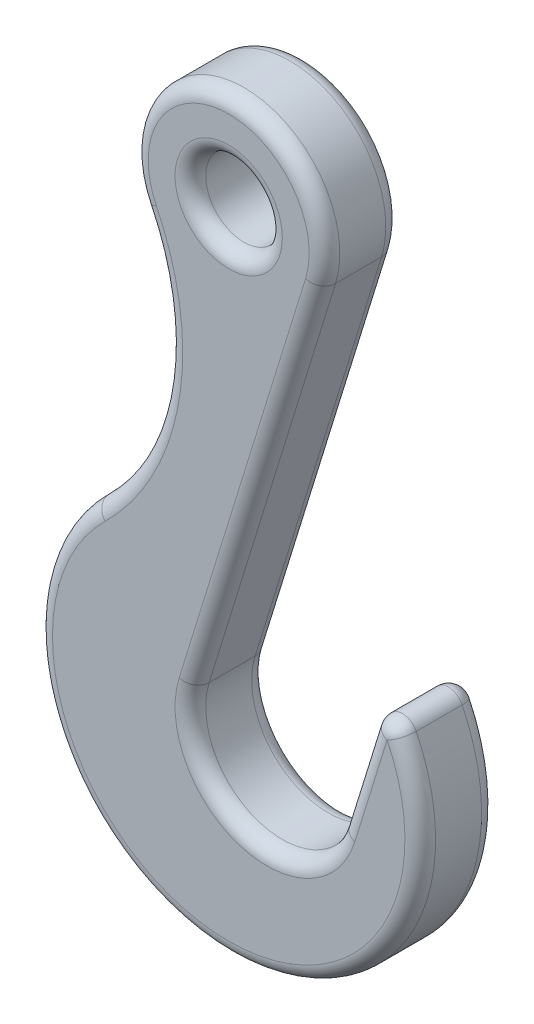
ISO-10303-21;
HEADER;
FILE_DESCRIPTION(('STEP AP214'),'2;1');
FILE_NAME('part.step','',(''),(''),'','','');
FILE_SCHEMA(('AUTOMOTIVE_DESIGN { 1 0 10303 214 1 1 1 1 }'));
ENDSEC;
DATA;
#1=APPLICATION_CONTEXT('core data for automotive mechanical design processes');
#2=APPLICATION_PROTOCOL_DEFINITION('international standard','automotive_design',2000,#1);
#3=PRODUCT_CONTEXT('',#1,'mechanical');
#4=PRODUCT('Part','Part','',(#3));
#5=PRODUCT_RELATED_PRODUCT_CATEGORY('part','',(#4));
#6=PRODUCT_DEFINITION_FORMATION('','',#4);
#7=PRODUCT_DEFINITION_CONTEXT('part definition',#1,'design');
#8=PRODUCT_DEFINITION('design','',#6,#7);
#9=PRODUCT_DEFINITION_SHAPE('','',#8);
#10=(LENGTH_UNIT() NAMED_UNIT(*) SI_UNIT(.MILLI.,.METRE.));
#11=(NAMED_UNIT(*) PLANE_ANGLE_UNIT() SI_UNIT($,.RADIAN.));
#12=(NAMED_UNIT(*) SI_UNIT($,.STERADIAN.) SOLID_ANGLE_UNIT());
#13=UNCERTAINTY_MEASURE_WITH_UNIT(LENGTH_MEASURE(1.E-05),#10,'distance_accuracy_value','');
#14=(GEOMETRIC_REPRESENTATION_CONTEXT(3) GLOBAL_UNCERTAINTY_ASSIGNED_CONTEXT((#13)) GLOBAL_UNIT_ASSIGNED_CONTEXT((#10,
#11,#12)) REPRESENTATION_CONTEXT('',''));
#15=CARTESIAN_POINT('',(0.,0.,0.));
#16=DIRECTION('',(0.,0.,1.));
#17=DIRECTION('',(1.,0.,0.));
#18=AXIS2_PLACEMENT_3D('',#15,#16,#17);
#19=CARTESIAN_POINT('',(0.,60.,10.));
#20=DIRECTION('',(0.,0.,1.));
#21=DIRECTION('',(1.,0.,0.));
#22=AXIS2_PLACEMENT_3D('',#19,#20,#21);
#23=PLANE('',#22);
#24=CARTESIAN_POINT('',(0.,60.,10.));
#25=DIRECTION('',(0.,0.,1.));
#26=DIRECTION('',(1.,0.,0.));
#27=AXIS2_PLACEMENT_3D('',#24,#25,#26);
#28=CIRCLE('',#27,7.);
#29=CARTESIAN_POINT('',(7.,60.,10.));
#30=VERTEX_POINT('',#29);
#31=EDGE_CURVE('E11',#30,#30,#28,.F.);
#32=ORIENTED_EDGE('',*,*,#31,.T.);
#33=EDGE_LOOP('',(#32));
#34=FACE_BOUND('',#33,.T.);
#35=CARTESIAN_POINT('',(0.,60.,10.));
#36=DIRECTION('',(0.,0.,1.));
#37=DIRECTION('',(1.,0.,0.));
#38=AXIS2_PLACEMENT_3D('',#35,#36,#37);
#39=CIRCLE('',#38,10.5);
#40=CARTESIAN_POINT('',(10.0314717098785,56.8984559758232,10.));
#41=VERTEX_POINT('',#40);
#42=CARTESIAN_POINT('',(-9.43422721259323,55.3907314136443,10.));
#43=VERTEX_POINT('',#42);
#44=EDGE_CURVE('E51',#41,#43,#39,.T.);
#45=ORIENTED_EDGE('',*,*,#44,.T.);
#46=CARTESIAN_POINT('',(-39.8340274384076,40.5383390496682,10.));
#47=DIRECTION('',(0.,0.,1.));
#48=DIRECTION('',(1.,0.,0.));
#49=AXIS2_PLACEMENT_3D('',#46,#47,#48);
#50=CIRCLE('',#49,33.8340274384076);
#51=CARTESIAN_POINT('',(-16.1203186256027,16.4053444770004,10.));
#52=VERTEX_POINT('',#51);
#53=EDGE_CURVE('E43',#43,#52,#50,.F.);
#54=ORIENTED_EDGE('',*,*,#53,.T.);
#55=CARTESIAN_POINT('',(0.,0.,10.));
#56=DIRECTION('',(0.,0.,1.));
#57=DIRECTION('',(1.,0.,0.));
#58=AXIS2_PLACEMENT_3D('',#55,#56,#57);
#59=CIRCLE('',#58,23.);
#60=CARTESIAN_POINT('',(20.6756526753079,10.0755836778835,10.));
#61=VERTEX_POINT('',#60);
#62=EDGE_CURVE('E200',#52,#61,#59,.T.);
#63=ORIENTED_EDGE('',*,*,#62,.T.);
#64=DIRECTION('',(-0.295385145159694,-0.955378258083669,0.));
#65=VECTOR('',#64,1.);
#66=CARTESIAN_POINT('',(16.464539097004,-3.54462174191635,10.));
#67=LINE('',#66,#65);
#68=CARTESIAN_POINT('',(16.464539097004,-3.54462174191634,10.));
#69=VERTEX_POINT('',#68);
#70=EDGE_CURVE('E202',#61,#69,#67,.T.);
#71=ORIENTED_EDGE('',*,*,#70,.T.);
#72=CARTESIAN_POINT('',(5.,0.,10.));
#73=DIRECTION('',(0.,0.,1.));
#74=DIRECTION('',(1.,0.,0.));
#75=AXIS2_PLACEMENT_3D('',#72,#73,#74);
#76=CIRCLE('',#75,12.);
#77=CARTESIAN_POINT('',(-6.46453909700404,3.54462174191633,10.));
#78=VERTEX_POINT('',#77);
#79=EDGE_CURVE('E204',#69,#78,#76,.F.);
#80=ORIENTED_EDGE('',*,*,#79,.T.);
#81=DIRECTION('',(0.295385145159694,0.955378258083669,0.));
#82=VECTOR('',#81,1.);
#83=CARTESIAN_POINT('',(10.0314717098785,56.8984559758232,10.));
#84=LINE('',#83,#82);
#85=EDGE_CURVE('E56',#78,#41,#84,.T.);
#86=ORIENTED_EDGE('',*,*,#85,.T.);
#87=EDGE_LOOP('',(#45,#54,#63,#71,#80,#86));
#88=FACE_BOUND('',#87,.T.);
#89=ADVANCED_FACE('F34',(#34,#88),#23,.T.);
#90=CARTESIAN_POINT('',(0.,60.,0.));
#91=DIRECTION('',(0.,0.,1.));
#92=DIRECTION('',(1.,0.,0.));
#93=AXIS2_PLACEMENT_3D('',#90,#91,#92);
#94=PLANE('',#93);
#95=CARTESIAN_POINT('',(0.,60.,0.));
#96=DIRECTION('',(0.,0.,1.));
#97=DIRECTION('',(1.,0.,0.));
#98=AXIS2_PLACEMENT_3D('',#95,#96,#97);
#99=CIRCLE('',#98,7.);
#100=CARTESIAN_POINT('',(7.,60.,0.));
#101=VERTEX_POINT('',#100);
#102=EDGE_CURVE('E158',#101,#101,#99,.T.);
#103=ORIENTED_EDGE('',*,*,#102,.T.);
#104=EDGE_LOOP('',(#103));
#105=FACE_BOUND('',#104,.T.);
#106=DIRECTION('',(0.295385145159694,0.955378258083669,0.));
#107=VECTOR('',#106,1.);
#108=CARTESIAN_POINT('',(10.0314717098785,56.8984559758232,0.));
#109=LINE('',#108,#107);
#110=CARTESIAN_POINT('',(10.0314717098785,56.8984559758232,0.));
#111=VERTEX_POINT('',#110);
#112=CARTESIAN_POINT('',(-6.46453909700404,3.54462174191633,0.));
#113=VERTEX_POINT('',#112);
#114=EDGE_CURVE('E157',#111,#113,#109,.F.);
#115=ORIENTED_EDGE('',*,*,#114,.T.);
#116=CARTESIAN_POINT('',(5.,0.,0.));
#117=DIRECTION('',(0.,0.,1.));
#118=DIRECTION('',(1.,0.,0.));
#119=AXIS2_PLACEMENT_3D('',#116,#117,#118);
#120=CIRCLE('',#119,12.);
#121=CARTESIAN_POINT('',(16.464539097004,-3.54462174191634,0.));
#122=VERTEX_POINT('',#121);
#123=EDGE_CURVE('E136',#113,#122,#120,.T.);
#124=ORIENTED_EDGE('',*,*,#123,.T.);
#125=DIRECTION('',(-0.295385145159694,-0.955378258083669,0.));
#126=VECTOR('',#125,1.);
#127=CARTESIAN_POINT('',(32.9605499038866,49.8092124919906,0.));
#128=LINE('',#127,#126);
#129=CARTESIAN_POINT('',(20.6756526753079,10.0755836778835,0.));
#130=VERTEX_POINT('',#129);
#131=EDGE_CURVE('E146',#122,#130,#128,.F.);
#132=ORIENTED_EDGE('',*,*,#131,.T.);
#133=CARTESIAN_POINT('',(0.,0.,0.));
#134=DIRECTION('',(0.,0.,1.));
#135=DIRECTION('',(1.,0.,0.));
#136=AXIS2_PLACEMENT_3D('',#133,#134,#135);
#137=CIRCLE('',#136,23.);
#138=CARTESIAN_POINT('',(-16.1203186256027,16.4053444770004,0.));
#139=VERTEX_POINT('',#138);
#140=EDGE_CURVE('E152',#130,#139,#137,.F.);
#141=ORIENTED_EDGE('',*,*,#140,.T.);
#142=CARTESIAN_POINT('',(-39.8340274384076,40.5383390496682,0.));
#143=DIRECTION('',(0.,0.,1.));
#144=DIRECTION('',(1.,0.,0.));
#145=AXIS2_PLACEMENT_3D('',#142,#143,#144);
#146=CIRCLE('',#145,33.8340274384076);
#147=CARTESIAN_POINT('',(-9.43422721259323,55.3907314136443,0.));
#148=VERTEX_POINT('',#147);
#149=EDGE_CURVE('E279',#139,#148,#146,.T.);
#150=ORIENTED_EDGE('',*,*,#149,.T.);
#151=CARTESIAN_POINT('',(0.,60.,0.));
#152=DIRECTION('',(0.,0.,1.));
#153=DIRECTION('',(1.,0.,0.));
#154=AXIS2_PLACEMENT_3D('',#151,#152,#153);
#155=CIRCLE('',#154,10.5);
#156=EDGE_CURVE('E163',#148,#111,#155,.F.);
#157=ORIENTED_EDGE('',*,*,#156,.T.);
#158=EDGE_LOOP('',(#115,#124,#132,#141,#150,#157));
#159=FACE_BOUND('',#158,.T.);
#160=ADVANCED_FACE('F155',(#105,#159),#94,.F.);
#161=CARTESIAN_POINT('',(0.,60.,10.));
#162=DIRECTION('',(0.,0.,-1.));
#163=DIRECTION('',(-1.,0.,0.));
#164=AXIS2_PLACEMENT_3D('',#161,#162,#163);
#165=CYLINDRICAL_SURFACE('',#164,12.5);
#166=DIRECTION('',(0.,0.,-1.));
#167=VECTOR('',#166,1.);
#168=CARTESIAN_POINT('',(11.9422282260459,56.3076856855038,10.));
#169=LINE('',#168,#167);
#170=CARTESIAN_POINT('',(11.9422282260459,56.3076856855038,8.));
#171=VERTEX_POINT('',#170);
#172=CARTESIAN_POINT('',(11.9422282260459,56.3076856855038,2.));
#173=VERTEX_POINT('',#172);
#174=EDGE_CURVE('E222',#171,#173,#169,.T.);
#175=ORIENTED_EDGE('',*,*,#174,.T.);
#176=CARTESIAN_POINT('',(0.,60.,2.));
#177=DIRECTION('',(0.,0.,1.));
#178=DIRECTION('',(1.,0.,0.));
#179=AXIS2_PLACEMENT_3D('',#176,#177,#178);
#180=CIRCLE('',#179,12.5);
#181=CARTESIAN_POINT('',(-11.2312228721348,54.5127754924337,2.));
#182=VERTEX_POINT('',#181);
#183=EDGE_CURVE('E181',#173,#182,#180,.T.);
#184=ORIENTED_EDGE('',*,*,#183,.T.);
#185=DIRECTION('',(0.,0.,-1.));
#186=VECTOR('',#185,1.);
#187=CARTESIAN_POINT('',(-11.2312228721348,54.5127754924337,10.));
#188=LINE('',#187,#186);
#189=CARTESIAN_POINT('',(-11.2312228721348,54.5127754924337,8.));
#190=VERTEX_POINT('',#189);
#191=EDGE_CURVE('E274',#190,#182,#188,.T.);
#192=ORIENTED_EDGE('',*,*,#191,.F.);
#193=CARTESIAN_POINT('',(0.,60.,8.));
#194=DIRECTION('',(0.,0.,1.));
#195=DIRECTION('',(1.,0.,0.));
#196=AXIS2_PLACEMENT_3D('',#193,#194,#195);
#197=CIRCLE('',#196,12.5);
#198=EDGE_CURVE('E179',#190,#171,#197,.F.);
#199=ORIENTED_EDGE('',*,*,#198,.T.);
#200=EDGE_LOOP('',(#175,#184,#192,#199));
#201=FACE_BOUND('',#200,.T.);
#202=ADVANCED_FACE('F338',(#201),#165,.T.);
#203=CARTESIAN_POINT('',(-39.8340274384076,40.5383390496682,10.));
#204=DIRECTION('',(0.,0.,-1.));
#205=DIRECTION('',(-1.,0.,0.));
#206=AXIS2_PLACEMENT_3D('',#203,#204,#205);
#207=CYLINDRICAL_SURFACE('',#206,31.8340274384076);
#208=ORIENTED_EDGE('',*,*,#191,.T.);
#209=CARTESIAN_POINT('',(-39.8340274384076,40.5383390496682,2.));
#210=DIRECTION('',(0.,0.,1.));
#211=DIRECTION('',(1.,0.,0.));
#212=AXIS2_PLACEMENT_3D('',#209,#210,#211);
#213=CIRCLE('',#212,31.8340274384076);
#214=CARTESIAN_POINT('',(-17.5220854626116,17.8318961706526,2.));
#215=VERTEX_POINT('',#214);
#216=EDGE_CURVE('E186',#182,#215,#213,.F.);
#217=ORIENTED_EDGE('',*,*,#216,.T.);
#218=DIRECTION('',(0.,0.,-1.));
#219=VECTOR('',#218,1.);
#220=CARTESIAN_POINT('',(-17.5220854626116,17.8318961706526,10.));
#221=LINE('',#220,#219);
#222=CARTESIAN_POINT('',(-17.5220854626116,17.8318961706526,8.));
#223=VERTEX_POINT('',#222);
#224=EDGE_CURVE('E303',#223,#215,#221,.T.);
#225=ORIENTED_EDGE('',*,*,#224,.F.);
#226=CARTESIAN_POINT('',(-39.8340274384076,40.5383390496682,8.));
#227=DIRECTION('',(0.,0.,1.));
#228=DIRECTION('',(1.,0.,0.));
#229=AXIS2_PLACEMENT_3D('',#226,#227,#228);
#230=CIRCLE('',#229,31.8340274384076);
#231=EDGE_CURVE('E183',#223,#190,#230,.T.);
#232=ORIENTED_EDGE('',*,*,#231,.T.);
#233=EDGE_LOOP('',(#208,#217,#225,#232));
#234=FACE_BOUND('',#233,.T.);
#235=ADVANCED_FACE('F311',(#234),#207,.F.);
#236=CARTESIAN_POINT('',(0.,0.,10.));
#237=DIRECTION('',(0.,0.,-1.));
#238=DIRECTION('',(-1.,0.,0.));
#239=AXIS2_PLACEMENT_3D('',#236,#237,#238);
#240=CYLINDRICAL_SURFACE('',#239,25.);
#241=ORIENTED_EDGE('',*,*,#224,.T.);
#242=CARTESIAN_POINT('',(0.,0.,2.));
#243=DIRECTION('',(0.,0.,1.));
#244=DIRECTION('',(1.,0.,0.));
#245=AXIS2_PLACEMENT_3D('',#242,#243,#244);
#246=CIRCLE('',#245,25.);
#247=CARTESIAN_POINT('',(22.473535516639,10.9517213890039,2.));
#248=VERTEX_POINT('',#247);
#249=EDGE_CURVE('E190',#215,#248,#246,.T.);
#250=ORIENTED_EDGE('',*,*,#249,.T.);
#251=DIRECTION('',(0.,0.,-1.));
#252=VECTOR('',#251,1.);
#253=CARTESIAN_POINT('',(22.473535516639,10.9517213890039,10.));
#254=LINE('',#253,#252);
#255=CARTESIAN_POINT('',(22.473535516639,10.9517213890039,8.));
#256=VERTEX_POINT('',#255);
#257=EDGE_CURVE('E153',#248,#256,#254,.F.);
#258=ORIENTED_EDGE('',*,*,#257,.T.);
#259=CARTESIAN_POINT('',(0.,0.,8.));
#260=DIRECTION('',(0.,0.,1.));
#261=DIRECTION('',(1.,0.,0.));
#262=AXIS2_PLACEMENT_3D('',#259,#260,#261);
#263=CIRCLE('',#262,25.);
#264=EDGE_CURVE('E188',#256,#223,#263,.F.);
#265=ORIENTED_EDGE('',*,*,#264,.T.);
#266=EDGE_LOOP('',(#241,#250,#258,#265));
#267=FACE_BOUND('',#266,.T.);
#268=ADVANCED_FACE('F270',(#267),#240,.T.);
#269=CARTESIAN_POINT('',(14.5537825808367,-2.95385145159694,10.));
#270=DIRECTION('',(0.955378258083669,-0.295385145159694,0.));
#271=DIRECTION('',(0.295385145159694,0.955378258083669,0.));
#272=AXIS2_PLACEMENT_3D('',#269,#270,#271);
#273=PLANE('',#272);
#274=DIRECTION('',(0.,0.,-1.));
#275=VECTOR('',#274,1.);
#276=CARTESIAN_POINT('',(18.7648961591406,10.6663539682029,10.));
#277=LINE('',#276,#275);
#278=CARTESIAN_POINT('',(18.7648961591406,10.6663539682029,8.));
#279=VERTEX_POINT('',#278);
#280=CARTESIAN_POINT('',(18.7648961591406,10.6663539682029,2.));
#281=VERTEX_POINT('',#280);
#282=EDGE_CURVE('E267',#279,#281,#277,.T.);
#283=ORIENTED_EDGE('',*,*,#282,.T.);
#284=DIRECTION('',(-0.295385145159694,-0.955378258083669,0.));
#285=VECTOR('',#284,1.);
#286=CARTESIAN_POINT('',(14.5537825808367,-2.95385145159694,2.));
#287=LINE('',#286,#285);
#288=CARTESIAN_POINT('',(14.5537825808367,-2.95385145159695,2.));
#289=VERTEX_POINT('',#288);
#290=EDGE_CURVE('E198',#281,#289,#287,.T.);
#291=ORIENTED_EDGE('',*,*,#290,.T.);
#292=DIRECTION('',(0.,0.,-1.));
#293=VECTOR('',#292,1.);
#294=CARTESIAN_POINT('',(14.5537825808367,-2.95385145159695,10.));
#295=LINE('',#294,#293);
#296=CARTESIAN_POINT('',(14.5537825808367,-2.95385145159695,8.));
#297=VERTEX_POINT('',#296);
#298=EDGE_CURVE('E300',#297,#289,#295,.T.);
#299=ORIENTED_EDGE('',*,*,#298,.F.);
#300=DIRECTION('',(-0.295385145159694,-0.955378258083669,0.));
#301=VECTOR('',#300,1.);
#302=CARTESIAN_POINT('',(18.7648961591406,10.6663539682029,8.));
#303=LINE('',#302,#301);
#304=EDGE_CURVE('E196',#297,#279,#303,.F.);
#305=ORIENTED_EDGE('',*,*,#304,.T.);
#306=EDGE_LOOP('',(#283,#291,#299,#305));
#307=FACE_BOUND('',#306,.T.);
#308=ADVANCED_FACE('F323',(#307),#273,.F.);
#309=CARTESIAN_POINT('',(5.,0.,10.));
#310=DIRECTION('',(0.,0.,-1.));
#311=DIRECTION('',(-1.,0.,0.));
#312=AXIS2_PLACEMENT_3D('',#309,#310,#311);
#313=CYLINDRICAL_SURFACE('',#312,10.);
#314=ORIENTED_EDGE('',*,*,#298,.T.);
#315=CARTESIAN_POINT('',(5.,0.,2.));
#316=DIRECTION('',(0.,0.,1.));
#317=DIRECTION('',(1.,0.,0.));
#318=AXIS2_PLACEMENT_3D('',#315,#316,#317);
#319=CIRCLE('',#318,10.);
#320=CARTESIAN_POINT('',(-4.5537825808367,2.95385145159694,2.));
#321=VERTEX_POINT('',#320);
#322=EDGE_CURVE('E139',#289,#321,#319,.F.);
#323=ORIENTED_EDGE('',*,*,#322,.T.);
#324=DIRECTION('',(0.,0.,-1.));
#325=VECTOR('',#324,1.);
#326=CARTESIAN_POINT('',(-4.5537825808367,2.95385145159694,10.));
#327=LINE('',#326,#325);
#328=CARTESIAN_POINT('',(-4.5537825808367,2.95385145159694,8.));
#329=VERTEX_POINT('',#328);
#330=EDGE_CURVE('E298',#329,#321,#327,.T.);
#331=ORIENTED_EDGE('',*,*,#330,.F.);
#332=CARTESIAN_POINT('',(5.,0.,8.));
#333=DIRECTION('',(0.,0.,1.));
#334=DIRECTION('',(1.,0.,0.));
#335=AXIS2_PLACEMENT_3D('',#332,#333,#334);
#336=CIRCLE('',#335,10.);
#337=EDGE_CURVE('E172',#329,#297,#336,.T.);
#338=ORIENTED_EDGE('',*,*,#337,.T.);
#339=EDGE_LOOP('',(#314,#323,#331,#338));
#340=FACE_BOUND('',#339,.T.);
#341=ADVANCED_FACE('F297',(#340),#313,.F.);
#342=CARTESIAN_POINT('',(11.9422282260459,56.3076856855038,10.));
#343=DIRECTION('',(-0.955378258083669,0.295385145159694,0.));
#344=DIRECTION('',(-0.295385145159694,-0.955378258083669,0.));
#345=AXIS2_PLACEMENT_3D('',#342,#343,#344);
#346=PLANE('',#345);
#347=ORIENTED_EDGE('',*,*,#330,.T.);
#348=DIRECTION('',(0.295385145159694,0.955378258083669,0.));
#349=VECTOR('',#348,1.);
#350=CARTESIAN_POINT('',(11.9422282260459,56.3076856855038,2.));
#351=LINE('',#350,#349);
#352=EDGE_CURVE('E177',#321,#173,#351,.T.);
#353=ORIENTED_EDGE('',*,*,#352,.T.);
#354=ORIENTED_EDGE('',*,*,#174,.F.);
#355=DIRECTION('',(0.295385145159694,0.955378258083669,0.));
#356=VECTOR('',#355,1.);
#357=CARTESIAN_POINT('',(-4.55378258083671,2.95385145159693,8.));
#358=LINE('',#357,#356);
#359=EDGE_CURVE('E175',#171,#329,#358,.F.);
#360=ORIENTED_EDGE('',*,*,#359,.T.);
#361=EDGE_LOOP('',(#347,#353,#354,#360));
#362=FACE_BOUND('',#361,.T.);
#363=ADVANCED_FACE('F301',(#362),#346,.F.);
#364=CARTESIAN_POINT('',(0.,60.,10.));
#365=DIRECTION('',(0.,0.,-1.));
#366=DIRECTION('',(-1.,0.,0.));
#367=AXIS2_PLACEMENT_3D('',#364,#365,#366);
#368=CYLINDRICAL_SURFACE('',#367,5.);
#369=CARTESIAN_POINT('',(0.,60.,2.));
#370=DIRECTION('',(0.,0.,1.));
#371=DIRECTION('',(1.,0.,0.));
#372=AXIS2_PLACEMENT_3D('',#369,#370,#371);
#373=CIRCLE('',#372,5.);
#374=CARTESIAN_POINT('',(5.,60.,2.));
#375=VERTEX_POINT('',#374);
#376=EDGE_CURVE('E169',#375,#375,#373,.F.);
#377=ORIENTED_EDGE('',*,*,#376,.T.);
#378=EDGE_LOOP('',(#377));
#379=FACE_BOUND('',#378,.T.);
#380=CARTESIAN_POINT('',(0.,60.,8.));
#381=DIRECTION('',(0.,0.,1.));
#382=DIRECTION('',(1.,0.,0.));
#383=AXIS2_PLACEMENT_3D('',#380,#381,#382);
#384=CIRCLE('',#383,5.);
#385=CARTESIAN_POINT('',(5.,60.,8.));
#386=VERTEX_POINT('',#385);
#387=EDGE_CURVE('E161',#386,#386,#384,.T.);
#388=ORIENTED_EDGE('',*,*,#387,.T.);
#389=EDGE_LOOP('',(#388));
#390=FACE_BOUND('',#389,.T.);
#391=ADVANCED_FACE('F342',(#379,#390),#368,.F.);
#392=CARTESIAN_POINT('',(20.6756526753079,10.0755836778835,10.));
#393=DIRECTION('',(0.,0.,-1.));
#394=DIRECTION('',(-1.,0.,0.));
#395=AXIS2_PLACEMENT_3D('',#392,#393,#394);
#396=CYLINDRICAL_SURFACE('',#395,2.);
#397=ORIENTED_EDGE('',*,*,#257,.F.);
#398=CARTESIAN_POINT('',(20.6756526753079,10.0755836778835,2.));
#399=DIRECTION('',(0.,0.,-1.));
#400=DIRECTION('',(-1.,0.,0.));
#401=AXIS2_PLACEMENT_3D('',#398,#399,#400);
#402=CIRCLE('',#401,2.);
#403=EDGE_CURVE('E194',#248,#281,#402,.F.);
#404=ORIENTED_EDGE('',*,*,#403,.T.);
#405=ORIENTED_EDGE('',*,*,#282,.F.);
#406=CARTESIAN_POINT('',(20.6756526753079,10.0755836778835,8.));
#407=DIRECTION('',(0.,0.,-1.));
#408=DIRECTION('',(-1.,0.,0.));
#409=AXIS2_PLACEMENT_3D('',#406,#407,#408);
#410=CIRCLE('',#409,2.);
#411=EDGE_CURVE('E192',#279,#256,#410,.T.);
#412=ORIENTED_EDGE('',*,*,#411,.T.);
#413=EDGE_LOOP('',(#397,#404,#405,#412));
#414=FACE_BOUND('',#413,.T.);
#415=ADVANCED_FACE('F264',(#414),#396,.T.);
#416=CARTESIAN_POINT('',(0.,60.,2.));
#417=DIRECTION('',(0.,0.,1.));
#418=DIRECTION('',(1.,0.,0.));
#419=AXIS2_PLACEMENT_3D('',#416,#417,#418);
#420=TOROIDAL_SURFACE('',#419,7.,2.);
#421=ORIENTED_EDGE('',*,*,#376,.F.);
#422=EDGE_LOOP('',(#421));
#423=FACE_BOUND('',#422,.T.);
#424=ORIENTED_EDGE('',*,*,#102,.F.);
#425=EDGE_LOOP('',(#424));
#426=FACE_BOUND('',#425,.T.);
#427=ADVANCED_FACE('F352',(#423,#426),#420,.T.);
#428=CARTESIAN_POINT('',(0.,0.,2.));
#429=DIRECTION('',(0.,0.,1.));
#430=DIRECTION('',(1.,0.,0.));
#431=AXIS2_PLACEMENT_3D('',#428,#429,#430);
#432=TOROIDAL_SURFACE('',#431,23.,2.);
#433=CARTESIAN_POINT('',(20.6756526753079,10.0755836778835,2.));
#434=DIRECTION('',(-0.438068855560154,0.898941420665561,0.));
#435=DIRECTION('',(-0.898941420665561,-0.438068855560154,0.));
#436=AXIS2_PLACEMENT_3D('',#433,#434,#435);
#437=CIRCLE('',#436,2.);
#438=EDGE_CURVE('E216',#248,#130,#437,.T.);
#439=ORIENTED_EDGE('',*,*,#438,.F.);
#440=ORIENTED_EDGE('',*,*,#249,.F.);
#441=CARTESIAN_POINT('',(-16.1203186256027,16.4053444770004,2.));
#442=DIRECTION('',(0.713275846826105,0.700883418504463,0.));
#443=DIRECTION('',(-0.700883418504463,0.713275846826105,0.));
#444=AXIS2_PLACEMENT_3D('',#441,#442,#443);
#445=CIRCLE('',#444,2.);
#446=EDGE_CURVE('E219',#139,#215,#445,.T.);
#447=ORIENTED_EDGE('',*,*,#446,.F.);
#448=ORIENTED_EDGE('',*,*,#140,.F.);
#449=EDGE_LOOP('',(#439,#440,#447,#448));
#450=FACE_BOUND('',#449,.T.);
#451=ADVANCED_FACE('F318',(#450),#432,.T.);
#452=CARTESIAN_POINT('',(-39.8340274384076,40.5383390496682,2.));
#453=DIRECTION('',(0.,0.,1.));
#454=DIRECTION('',(1.,0.,0.));
#455=AXIS2_PLACEMENT_3D('',#452,#453,#454);
#456=TOROIDAL_SURFACE('',#455,33.8340274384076,2.);
#457=ORIENTED_EDGE('',*,*,#446,.T.);
#458=ORIENTED_EDGE('',*,*,#216,.F.);
#459=CARTESIAN_POINT('',(-9.43422721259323,55.3907314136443,2.));
#460=DIRECTION('',(-0.438977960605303,0.898497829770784,0.));
#461=DIRECTION('',(-0.898497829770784,-0.438977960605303,0.));
#462=AXIS2_PLACEMENT_3D('',#459,#460,#461);
#463=CIRCLE('',#462,2.);
#464=EDGE_CURVE('E213',#148,#182,#463,.T.);
#465=ORIENTED_EDGE('',*,*,#464,.F.);
#466=ORIENTED_EDGE('',*,*,#149,.F.);
#467=EDGE_LOOP('',(#457,#458,#465,#466));
#468=FACE_BOUND('',#467,.T.);
#469=ADVANCED_FACE('F315',(#468),#456,.T.);
#470=CARTESIAN_POINT('',(20.6756526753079,10.0755836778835,2.));
#471=DIRECTION('',(0.,0.,1.));
#472=DIRECTION('',(1.,0.,0.));
#473=AXIS2_PLACEMENT_3D('',#470,#471,#472);
#474=SPHERICAL_SURFACE('',#473,2.);
#475=ORIENTED_EDGE('',*,*,#403,.F.);
#476=ORIENTED_EDGE('',*,*,#438,.T.);
#477=CARTESIAN_POINT('',(20.6756526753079,10.0755836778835,2.));
#478=DIRECTION('',(-0.295385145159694,-0.955378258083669,0.));
#479=DIRECTION('',(0.95537825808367,-0.295385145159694,0.));
#480=AXIS2_PLACEMENT_3D('',#477,#478,#479);
#481=CIRCLE('',#480,2.);
#482=EDGE_CURVE('E149',#281,#130,#481,.T.);
#483=ORIENTED_EDGE('',*,*,#482,.F.);
#484=EDGE_LOOP('',(#475,#476,#483));
#485=FACE_BOUND('',#484,.T.);
#486=ADVANCED_FACE('F321',(#485),#474,.T.);
#487=CARTESIAN_POINT('',(0.,60.,2.));
#488=DIRECTION('',(0.,0.,1.));
#489=DIRECTION('',(1.,0.,0.));
#490=AXIS2_PLACEMENT_3D('',#487,#488,#489);
#491=TOROIDAL_SURFACE('',#490,10.5,2.);
#492=ORIENTED_EDGE('',*,*,#464,.T.);
#493=ORIENTED_EDGE('',*,*,#183,.F.);
#494=CARTESIAN_POINT('',(10.0314717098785,56.8984559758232,2.));
#495=DIRECTION('',(-0.295385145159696,-0.955378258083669,0.));
#496=DIRECTION('',(0.955378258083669,-0.295385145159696,0.));
#497=AXIS2_PLACEMENT_3D('',#494,#495,#496);
#498=CIRCLE('',#497,2.);
#499=EDGE_CURVE('E142',#111,#173,#498,.T.);
#500=ORIENTED_EDGE('',*,*,#499,.F.);
#501=ORIENTED_EDGE('',*,*,#156,.F.);
#502=EDGE_LOOP('',(#492,#493,#500,#501));
#503=FACE_BOUND('',#502,.T.);
#504=ADVANCED_FACE('F286',(#503),#491,.T.);
#505=CARTESIAN_POINT('',(16.464539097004,-3.54462174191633,2.));
#506=DIRECTION('',(-0.295385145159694,-0.955378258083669,0.));
#507=DIRECTION('',(0.955378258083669,-0.295385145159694,0.));
#508=AXIS2_PLACEMENT_3D('',#505,#506,#507);
#509=CYLINDRICAL_SURFACE('',#508,2.);
#510=ORIENTED_EDGE('',*,*,#482,.T.);
#511=ORIENTED_EDGE('',*,*,#131,.F.);
#512=CARTESIAN_POINT('',(16.464539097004,-3.54462174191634,2.));
#513=DIRECTION('',(-0.295385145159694,-0.955378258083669,0.));
#514=DIRECTION('',(0.955378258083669,-0.295385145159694,0.));
#515=AXIS2_PLACEMENT_3D('',#512,#513,#514);
#516=CIRCLE('',#515,2.);
#517=EDGE_CURVE('E132',#289,#122,#516,.T.);
#518=ORIENTED_EDGE('',*,*,#517,.F.);
#519=ORIENTED_EDGE('',*,*,#290,.F.);
#520=EDGE_LOOP('',(#510,#511,#518,#519));
#521=FACE_BOUND('',#520,.T.);
#522=ADVANCED_FACE('F147',(#521),#509,.T.);
#523=CARTESIAN_POINT('',(10.0314717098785,56.8984559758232,2.));
#524=DIRECTION('',(0.295385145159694,0.955378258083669,0.));
#525=DIRECTION('',(-0.955378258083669,0.295385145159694,0.));
#526=AXIS2_PLACEMENT_3D('',#523,#524,#525);
#527=CYLINDRICAL_SURFACE('',#526,2.);
#528=ORIENTED_EDGE('',*,*,#499,.T.);
#529=ORIENTED_EDGE('',*,*,#352,.F.);
#530=CARTESIAN_POINT('',(-6.46453909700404,3.54462174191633,2.));
#531=DIRECTION('',(-0.295385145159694,-0.955378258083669,0.));
#532=DIRECTION('',(0.955378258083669,-0.295385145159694,0.));
#533=AXIS2_PLACEMENT_3D('',#530,#531,#532);
#534=CIRCLE('',#533,2.);
#535=EDGE_CURVE('E143',#113,#321,#534,.T.);
#536=ORIENTED_EDGE('',*,*,#535,.F.);
#537=ORIENTED_EDGE('',*,*,#114,.F.);
#538=EDGE_LOOP('',(#528,#529,#536,#537));
#539=FACE_BOUND('',#538,.T.);
#540=ADVANCED_FACE('F289',(#539),#527,.T.);
#541=CARTESIAN_POINT('',(5.,0.,2.));
#542=DIRECTION('',(0.,0.,1.));
#543=DIRECTION('',(1.,0.,0.));
#544=AXIS2_PLACEMENT_3D('',#541,#542,#543);
#545=TOROIDAL_SURFACE('',#544,12.,2.);
#546=ORIENTED_EDGE('',*,*,#517,.T.);
#547=ORIENTED_EDGE('',*,*,#123,.F.);
#548=ORIENTED_EDGE('',*,*,#535,.T.);
#549=ORIENTED_EDGE('',*,*,#322,.F.);
#550=EDGE_LOOP('',(#546,#547,#548,#549));
#551=FACE_BOUND('',#550,.T.);
#552=ADVANCED_FACE('F134',(#551),#545,.T.);
#553=CARTESIAN_POINT('',(0.,60.,8.));
#554=DIRECTION('',(0.,0.,1.));
#555=DIRECTION('',(1.,0.,0.));
#556=AXIS2_PLACEMENT_3D('',#553,#554,#555);
#557=TOROIDAL_SURFACE('',#556,7.,2.);
#558=ORIENTED_EDGE('',*,*,#31,.F.);
#559=EDGE_LOOP('',(#558));
#560=FACE_BOUND('',#559,.T.);
#561=ORIENTED_EDGE('',*,*,#387,.F.);
#562=EDGE_LOOP('',(#561));
#563=FACE_BOUND('',#562,.T.);
#564=ADVANCED_FACE('F358',(#560,#563),#557,.T.);
#565=CARTESIAN_POINT('',(5.,0.,8.));
#566=DIRECTION('',(0.,0.,1.));
#567=DIRECTION('',(1.,0.,0.));
#568=AXIS2_PLACEMENT_3D('',#565,#566,#567);
#569=TOROIDAL_SURFACE('',#568,12.,2.);
#570=CARTESIAN_POINT('',(-6.46453909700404,3.54462174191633,8.));
#571=DIRECTION('',(0.295385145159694,0.955378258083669,0.));
#572=DIRECTION('',(-0.955378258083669,0.295385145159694,0.));
#573=AXIS2_PLACEMENT_3D('',#570,#571,#572);
#574=CIRCLE('',#573,2.);
#575=EDGE_CURVE('E235',#78,#329,#574,.T.);
#576=ORIENTED_EDGE('',*,*,#575,.F.);
#577=ORIENTED_EDGE('',*,*,#79,.F.);
#578=CARTESIAN_POINT('',(16.464539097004,-3.54462174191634,8.));
#579=DIRECTION('',(0.295385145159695,0.955378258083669,0.));
#580=DIRECTION('',(-0.955378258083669,0.295385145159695,0.));
#581=AXIS2_PLACEMENT_3D('',#578,#579,#580);
#582=CIRCLE('',#581,2.);
#583=EDGE_CURVE('E38',#297,#69,#582,.T.);
#584=ORIENTED_EDGE('',*,*,#583,.F.);
#585=ORIENTED_EDGE('',*,*,#337,.F.);
#586=EDGE_LOOP('',(#576,#577,#584,#585));
#587=FACE_BOUND('',#586,.T.);
#588=ADVANCED_FACE('F36',(#587),#569,.T.);
#589=CARTESIAN_POINT('',(32.9605499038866,49.8092124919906,8.));
#590=DIRECTION('',(0.295385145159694,0.955378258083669,0.));
#591=DIRECTION('',(-0.955378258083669,0.295385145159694,0.));
#592=AXIS2_PLACEMENT_3D('',#589,#590,#591);
#593=CYLINDRICAL_SURFACE('',#592,2.);
#594=ORIENTED_EDGE('',*,*,#583,.T.);
#595=ORIENTED_EDGE('',*,*,#70,.F.);
#596=CARTESIAN_POINT('',(20.6756526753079,10.0755836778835,8.));
#597=DIRECTION('',(0.295385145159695,0.955378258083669,0.));
#598=DIRECTION('',(-0.955378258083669,0.295385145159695,0.));
#599=AXIS2_PLACEMENT_3D('',#596,#597,#598);
#600=CIRCLE('',#599,2.);
#601=EDGE_CURVE('E233',#279,#61,#600,.T.);
#602=ORIENTED_EDGE('',*,*,#601,.F.);
#603=ORIENTED_EDGE('',*,*,#304,.F.);
#604=EDGE_LOOP('',(#594,#595,#602,#603));
#605=FACE_BOUND('',#604,.T.);
#606=ADVANCED_FACE('F245',(#605),#593,.T.);
#607=CARTESIAN_POINT('',(10.0314717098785,56.8984559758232,8.));
#608=DIRECTION('',(-0.295385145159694,-0.955378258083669,0.));
#609=DIRECTION('',(0.955378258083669,-0.295385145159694,0.));
#610=AXIS2_PLACEMENT_3D('',#607,#608,#609);
#611=CYLINDRICAL_SURFACE('',#610,2.);
#612=ORIENTED_EDGE('',*,*,#575,.T.);
#613=ORIENTED_EDGE('',*,*,#359,.F.);
#614=CARTESIAN_POINT('',(10.0314717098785,56.8984559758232,8.));
#615=DIRECTION('',(0.295385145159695,0.955378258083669,0.));
#616=DIRECTION('',(-0.955378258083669,0.295385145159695,0.));
#617=AXIS2_PLACEMENT_3D('',#614,#615,#616);
#618=CIRCLE('',#617,2.);
#619=EDGE_CURVE('E230',#41,#171,#618,.T.);
#620=ORIENTED_EDGE('',*,*,#619,.F.);
#621=ORIENTED_EDGE('',*,*,#85,.F.);
#622=EDGE_LOOP('',(#612,#613,#620,#621));
#623=FACE_BOUND('',#622,.T.);
#624=ADVANCED_FACE('F383',(#623),#611,.T.);
#625=CARTESIAN_POINT('',(20.6756526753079,10.0755836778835,8.));
#626=DIRECTION('',(0.,0.,1.));
#627=DIRECTION('',(1.,0.,0.));
#628=AXIS2_PLACEMENT_3D('',#625,#626,#627);
#629=SPHERICAL_SURFACE('',#628,2.);
#630=ORIENTED_EDGE('',*,*,#411,.F.);
#631=ORIENTED_EDGE('',*,*,#601,.T.);
#632=CARTESIAN_POINT('',(20.6756526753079,10.0755836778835,8.));
#633=DIRECTION('',(0.438068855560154,-0.898941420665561,0.));
#634=DIRECTION('',(0.898941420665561,0.438068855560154,0.));
#635=AXIS2_PLACEMENT_3D('',#632,#633,#634);
#636=CIRCLE('',#635,2.);
#637=EDGE_CURVE('E227',#256,#61,#636,.T.);
#638=ORIENTED_EDGE('',*,*,#637,.F.);
#639=EDGE_LOOP('',(#630,#631,#638));
#640=FACE_BOUND('',#639,.T.);
#641=ADVANCED_FACE('F259',(#640),#629,.T.);
#642=CARTESIAN_POINT('',(0.,60.,8.));
#643=DIRECTION('',(0.,0.,1.));
#644=DIRECTION('',(1.,0.,0.));
#645=AXIS2_PLACEMENT_3D('',#642,#643,#644);
#646=TOROIDAL_SURFACE('',#645,10.5,2.);
#647=ORIENTED_EDGE('',*,*,#619,.T.);
#648=ORIENTED_EDGE('',*,*,#198,.F.);
#649=CARTESIAN_POINT('',(-9.43422721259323,55.3907314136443,8.));
#650=DIRECTION('',(0.438977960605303,-0.898497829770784,0.));
#651=DIRECTION('',(0.898497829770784,0.438977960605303,0.));
#652=AXIS2_PLACEMENT_3D('',#649,#650,#651);
#653=CIRCLE('',#652,2.);
#654=EDGE_CURVE('E225',#43,#190,#653,.T.);
#655=ORIENTED_EDGE('',*,*,#654,.F.);
#656=ORIENTED_EDGE('',*,*,#44,.F.);
#657=EDGE_LOOP('',(#647,#648,#655,#656));
#658=FACE_BOUND('',#657,.T.);
#659=ADVANCED_FACE('F377',(#658),#646,.T.);
#660=CARTESIAN_POINT('',(0.,0.,8.));
#661=DIRECTION('',(0.,0.,1.));
#662=DIRECTION('',(1.,0.,0.));
#663=AXIS2_PLACEMENT_3D('',#660,#661,#662);
#664=TOROIDAL_SURFACE('',#663,23.,2.);
#665=ORIENTED_EDGE('',*,*,#637,.T.);
#666=ORIENTED_EDGE('',*,*,#62,.F.);
#667=CARTESIAN_POINT('',(-16.1203186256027,16.4053444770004,8.));
#668=DIRECTION('',(0.713275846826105,0.700883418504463,0.));
#669=DIRECTION('',(-0.700883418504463,0.713275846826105,0.));
#670=AXIS2_PLACEMENT_3D('',#667,#668,#669);
#671=CIRCLE('',#670,2.);
#672=EDGE_CURVE('E223',#223,#52,#671,.T.);
#673=ORIENTED_EDGE('',*,*,#672,.F.);
#674=ORIENTED_EDGE('',*,*,#264,.F.);
#675=EDGE_LOOP('',(#665,#666,#673,#674));
#676=FACE_BOUND('',#675,.T.);
#677=ADVANCED_FACE('F254',(#676),#664,.T.);
#678=CARTESIAN_POINT('',(-39.8340274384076,40.5383390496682,8.));
#679=DIRECTION('',(0.,0.,1.));
#680=DIRECTION('',(1.,0.,0.));
#681=AXIS2_PLACEMENT_3D('',#678,#679,#680);
#682=TOROIDAL_SURFACE('',#681,33.8340274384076,2.);
#683=ORIENTED_EDGE('',*,*,#654,.T.);
#684=ORIENTED_EDGE('',*,*,#231,.F.);
#685=ORIENTED_EDGE('',*,*,#672,.T.);
#686=ORIENTED_EDGE('',*,*,#53,.F.);
#687=EDGE_LOOP('',(#683,#684,#685,#686));
#688=FACE_BOUND('',#687,.T.);
#689=ADVANCED_FACE('F371',(#688),#682,.T.);
#690=CLOSED_SHELL('',(#89,#160,#202,#235,#268,#308,#341,#363,#391,#415,#427,#451,#469,#486,#504,
#522,#540,#552,#564,#588,#606,#624,#641,#659,#677,#689));
#691=MANIFOLD_SOLID_BREP('B2',#690);
#692=ADVANCED_BREP_SHAPE_REPRESENTATION('',(#18,#691),#14);
#693=SHAPE_DEFINITION_REPRESENTATION(#9,#692);
ENDSEC;
END-ISO-10303-21;
